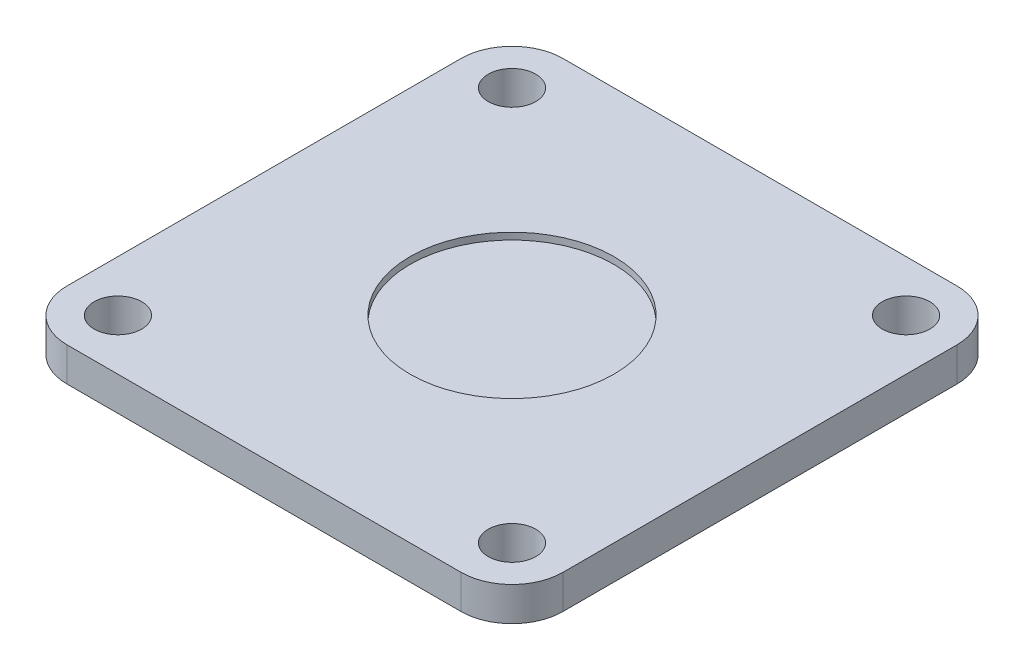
ISO-10303-21;
HEADER;
FILE_DESCRIPTION(('STEP AP214'),'2;1');
FILE_NAME('part.step','',(''),(''),'','','');
FILE_SCHEMA(('AUTOMOTIVE_DESIGN { 1 0 10303 214 1 1 1 1 }'));
ENDSEC;
DATA;
#1=APPLICATION_CONTEXT('core data for automotive mechanical design processes');
#2=APPLICATION_PROTOCOL_DEFINITION('international standard','automotive_design',2000,#1);
#3=PRODUCT_CONTEXT('',#1,'mechanical');
#4=PRODUCT('Part','Part','',(#3));
#5=PRODUCT_RELATED_PRODUCT_CATEGORY('part','',(#4));
#6=PRODUCT_DEFINITION_FORMATION('','',#4);
#7=PRODUCT_DEFINITION_CONTEXT('part definition',#1,'design');
#8=PRODUCT_DEFINITION('design','',#6,#7);
#9=PRODUCT_DEFINITION_SHAPE('','',#8);
#10=(LENGTH_UNIT() NAMED_UNIT(*) SI_UNIT(.MILLI.,.METRE.));
#11=(NAMED_UNIT(*) PLANE_ANGLE_UNIT() SI_UNIT($,.RADIAN.));
#12=(NAMED_UNIT(*) SI_UNIT($,.STERADIAN.) SOLID_ANGLE_UNIT());
#13=UNCERTAINTY_MEASURE_WITH_UNIT(LENGTH_MEASURE(1.E-05),#10,'distance_accuracy_value','');
#14=(GEOMETRIC_REPRESENTATION_CONTEXT(3) GLOBAL_UNCERTAINTY_ASSIGNED_CONTEXT((#13)) GLOBAL_UNIT_ASSIGNED_CONTEXT((#10,
#11,#12)) REPRESENTATION_CONTEXT('',''));
#15=CARTESIAN_POINT('',(0.,0.,0.));
#16=DIRECTION('',(0.,0.,1.));
#17=DIRECTION('',(1.,0.,0.));
#18=AXIS2_PLACEMENT_3D('',#15,#16,#17);
#19=CARTESIAN_POINT('',(29.,-5.,-36.5));
#20=DIRECTION('',(0.,0.,-1.));
#21=DIRECTION('',(0.,1.,0.));
#22=AXIS2_PLACEMENT_3D('',#19,#20,#21);
#23=PLANE('',#22);
#24=DIRECTION('',(-1.,0.,0.));
#25=VECTOR('',#24,1.);
#26=CARTESIAN_POINT('',(29.,0.,-36.5));
#27=LINE('',#26,#25);
#28=CARTESIAN_POINT('',(29.,0.,-36.5));
#29=VERTEX_POINT('',#28);
#30=CARTESIAN_POINT('',(-29.,0.,-36.5));
#31=VERTEX_POINT('',#30);
#32=EDGE_CURVE('E102',#29,#31,#27,.T.);
#33=ORIENTED_EDGE('',*,*,#32,.F.);
#34=DIRECTION('',(0.,1.,0.));
#35=VECTOR('',#34,1.);
#36=CARTESIAN_POINT('',(29.,-5.,-36.5));
#37=LINE('',#36,#35);
#38=CARTESIAN_POINT('',(29.,-5.,-36.5));
#39=VERTEX_POINT('',#38);
#40=EDGE_CURVE('E23',#39,#29,#37,.T.);
#41=ORIENTED_EDGE('',*,*,#40,.F.);
#42=DIRECTION('',(-1.,0.,0.));
#43=VECTOR('',#42,1.);
#44=CARTESIAN_POINT('',(29.,-5.,-36.5));
#45=LINE('',#44,#43);
#46=CARTESIAN_POINT('',(-29.,-5.,-36.5));
#47=VERTEX_POINT('',#46);
#48=EDGE_CURVE('E134',#39,#47,#45,.T.);
#49=ORIENTED_EDGE('',*,*,#48,.T.);
#50=DIRECTION('',(0.,1.,0.));
#51=VECTOR('',#50,1.);
#52=CARTESIAN_POINT('',(-29.,-5.,-36.5));
#53=LINE('',#52,#51);
#54=EDGE_CURVE('E94',#47,#31,#53,.T.);
#55=ORIENTED_EDGE('',*,*,#54,.T.);
#56=EDGE_LOOP('',(#33,#41,#49,#55));
#57=FACE_BOUND('',#56,.T.);
#58=ADVANCED_FACE('F15',(#57),#23,.T.);
#59=CARTESIAN_POINT('',(29.,-5.,-29.));
#60=DIRECTION('',(0.,1.,0.));
#61=DIRECTION('',(-1.,0.,0.));
#62=AXIS2_PLACEMENT_3D('',#59,#60,#61);
#63=CYLINDRICAL_SURFACE('',#62,7.5);
#64=CARTESIAN_POINT('',(29.,0.,-29.));
#65=DIRECTION('',(0.,-1.,0.));
#66=DIRECTION('',(1.,0.,0.));
#67=AXIS2_PLACEMENT_3D('',#64,#65,#66);
#68=CIRCLE('',#67,7.5);
#69=CARTESIAN_POINT('',(36.5,0.,-29.));
#70=VERTEX_POINT('',#69);
#71=EDGE_CURVE('E130',#29,#70,#68,.T.);
#72=ORIENTED_EDGE('',*,*,#71,.T.);
#73=DIRECTION('',(0.,1.,0.));
#74=VECTOR('',#73,1.);
#75=CARTESIAN_POINT('',(36.5,-5.,-29.));
#76=LINE('',#75,#74);
#77=CARTESIAN_POINT('',(36.5,-5.,-29.));
#78=VERTEX_POINT('',#77);
#79=EDGE_CURVE('E163',#78,#70,#76,.T.);
#80=ORIENTED_EDGE('',*,*,#79,.F.);
#81=CARTESIAN_POINT('',(29.,-5.,-29.));
#82=DIRECTION('',(0.,-1.,0.));
#83=DIRECTION('',(1.,0.,0.));
#84=AXIS2_PLACEMENT_3D('',#81,#82,#83);
#85=CIRCLE('',#84,7.5);
#86=EDGE_CURVE('E36',#39,#78,#85,.T.);
#87=ORIENTED_EDGE('',*,*,#86,.F.);
#88=ORIENTED_EDGE('',*,*,#40,.T.);
#89=EDGE_LOOP('',(#72,#80,#87,#88));
#90=FACE_BOUND('',#89,.T.);
#91=ADVANCED_FACE('F237',(#90),#63,.T.);
#92=CARTESIAN_POINT('',(36.5,-5.,29.));
#93=DIRECTION('',(1.,0.,0.));
#94=DIRECTION('',(0.,1.,0.));
#95=AXIS2_PLACEMENT_3D('',#92,#93,#94);
#96=PLANE('',#95);
#97=DIRECTION('',(0.,0.,-1.));
#98=VECTOR('',#97,1.);
#99=CARTESIAN_POINT('',(36.5,0.,29.));
#100=LINE('',#99,#98);
#101=CARTESIAN_POINT('',(36.5,0.,29.));
#102=VERTEX_POINT('',#101);
#103=EDGE_CURVE('E126',#102,#70,#100,.T.);
#104=ORIENTED_EDGE('',*,*,#103,.F.);
#105=DIRECTION('',(0.,1.,0.));
#106=VECTOR('',#105,1.);
#107=CARTESIAN_POINT('',(36.5,-5.,29.));
#108=LINE('',#107,#106);
#109=CARTESIAN_POINT('',(36.5,-5.,29.));
#110=VERTEX_POINT('',#109);
#111=EDGE_CURVE('E166',#110,#102,#108,.T.);
#112=ORIENTED_EDGE('',*,*,#111,.F.);
#113=DIRECTION('',(0.,0.,-1.));
#114=VECTOR('',#113,1.);
#115=CARTESIAN_POINT('',(36.5,-5.,29.));
#116=LINE('',#115,#114);
#117=EDGE_CURVE('E153',#110,#78,#116,.T.);
#118=ORIENTED_EDGE('',*,*,#117,.T.);
#119=ORIENTED_EDGE('',*,*,#79,.T.);
#120=EDGE_LOOP('',(#104,#112,#118,#119));
#121=FACE_BOUND('',#120,.T.);
#122=ADVANCED_FACE('F242',(#121),#96,.T.);
#123=CARTESIAN_POINT('',(29.,-5.,29.));
#124=DIRECTION('',(0.,1.,0.));
#125=DIRECTION('',(-1.,0.,0.));
#126=AXIS2_PLACEMENT_3D('',#123,#124,#125);
#127=CYLINDRICAL_SURFACE('',#126,7.5);
#128=CARTESIAN_POINT('',(29.,0.,29.));
#129=DIRECTION('',(0.,-1.,0.));
#130=DIRECTION('',(1.,0.,0.));
#131=AXIS2_PLACEMENT_3D('',#128,#129,#130);
#132=CIRCLE('',#131,7.5);
#133=CARTESIAN_POINT('',(29.,0.,36.5));
#134=VERTEX_POINT('',#133);
#135=EDGE_CURVE('E122',#102,#134,#132,.T.);
#136=ORIENTED_EDGE('',*,*,#135,.T.);
#137=DIRECTION('',(0.,1.,0.));
#138=VECTOR('',#137,1.);
#139=CARTESIAN_POINT('',(29.,-5.,36.5));
#140=LINE('',#139,#138);
#141=CARTESIAN_POINT('',(29.,-5.,36.5));
#142=VERTEX_POINT('',#141);
#143=EDGE_CURVE('E169',#142,#134,#140,.T.);
#144=ORIENTED_EDGE('',*,*,#143,.F.);
#145=CARTESIAN_POINT('',(29.,-5.,29.));
#146=DIRECTION('',(0.,-1.,0.));
#147=DIRECTION('',(1.,0.,0.));
#148=AXIS2_PLACEMENT_3D('',#145,#146,#147);
#149=CIRCLE('',#148,7.5);
#150=EDGE_CURVE('E150',#110,#142,#149,.T.);
#151=ORIENTED_EDGE('',*,*,#150,.F.);
#152=ORIENTED_EDGE('',*,*,#111,.T.);
#153=EDGE_LOOP('',(#136,#144,#151,#152));
#154=FACE_BOUND('',#153,.T.);
#155=ADVANCED_FACE('F248',(#154),#127,.T.);
#156=CARTESIAN_POINT('',(-29.,-5.,36.5));
#157=DIRECTION('',(0.,0.,1.));
#158=DIRECTION('',(0.,-1.,0.));
#159=AXIS2_PLACEMENT_3D('',#156,#157,#158);
#160=PLANE('',#159);
#161=DIRECTION('',(1.,0.,0.));
#162=VECTOR('',#161,1.);
#163=CARTESIAN_POINT('',(-29.,0.,36.5));
#164=LINE('',#163,#162);
#165=CARTESIAN_POINT('',(-29.,0.,36.5));
#166=VERTEX_POINT('',#165);
#167=EDGE_CURVE('E115',#166,#134,#164,.T.);
#168=ORIENTED_EDGE('',*,*,#167,.F.);
#169=DIRECTION('',(0.,1.,0.));
#170=VECTOR('',#169,1.);
#171=CARTESIAN_POINT('',(-29.,-5.,36.5));
#172=LINE('',#171,#170);
#173=CARTESIAN_POINT('',(-29.,-5.,36.5));
#174=VERTEX_POINT('',#173);
#175=EDGE_CURVE('E172',#174,#166,#172,.T.);
#176=ORIENTED_EDGE('',*,*,#175,.F.);
#177=DIRECTION('',(1.,0.,0.));
#178=VECTOR('',#177,1.);
#179=CARTESIAN_POINT('',(-29.,-5.,36.5));
#180=LINE('',#179,#178);
#181=EDGE_CURVE('E146',#174,#142,#180,.T.);
#182=ORIENTED_EDGE('',*,*,#181,.T.);
#183=ORIENTED_EDGE('',*,*,#143,.T.);
#184=EDGE_LOOP('',(#168,#176,#182,#183));
#185=FACE_BOUND('',#184,.T.);
#186=ADVANCED_FACE('F255',(#185),#160,.T.);
#187=CARTESIAN_POINT('',(-29.,-5.,29.));
#188=DIRECTION('',(0.,1.,0.));
#189=DIRECTION('',(-1.,0.,0.));
#190=AXIS2_PLACEMENT_3D('',#187,#188,#189);
#191=CYLINDRICAL_SURFACE('',#190,7.5);
#192=CARTESIAN_POINT('',(-29.,0.,29.));
#193=DIRECTION('',(0.,-1.,0.));
#194=DIRECTION('',(1.,0.,0.));
#195=AXIS2_PLACEMENT_3D('',#192,#193,#194);
#196=CIRCLE('',#195,7.5);
#197=CARTESIAN_POINT('',(-36.5,0.,29.));
#198=VERTEX_POINT('',#197);
#199=EDGE_CURVE('E109',#166,#198,#196,.T.);
#200=ORIENTED_EDGE('',*,*,#199,.T.);
#201=DIRECTION('',(0.,1.,0.));
#202=VECTOR('',#201,1.);
#203=CARTESIAN_POINT('',(-36.5,-5.,29.));
#204=LINE('',#203,#202);
#205=CARTESIAN_POINT('',(-36.5,-5.,29.));
#206=VERTEX_POINT('',#205);
#207=EDGE_CURVE('E93',#206,#198,#204,.T.);
#208=ORIENTED_EDGE('',*,*,#207,.F.);
#209=CARTESIAN_POINT('',(-29.,-5.,29.));
#210=DIRECTION('',(0.,-1.,0.));
#211=DIRECTION('',(1.,0.,0.));
#212=AXIS2_PLACEMENT_3D('',#209,#210,#211);
#213=CIRCLE('',#212,7.5);
#214=EDGE_CURVE('E143',#174,#206,#213,.T.);
#215=ORIENTED_EDGE('',*,*,#214,.F.);
#216=ORIENTED_EDGE('',*,*,#175,.T.);
#217=EDGE_LOOP('',(#200,#208,#215,#216));
#218=FACE_BOUND('',#217,.T.);
#219=ADVANCED_FACE('F259',(#218),#191,.T.);
#220=CARTESIAN_POINT('',(-36.5,-5.,-29.));
#221=DIRECTION('',(-1.,0.,0.));
#222=DIRECTION('',(0.,-1.,0.));
#223=AXIS2_PLACEMENT_3D('',#220,#221,#222);
#224=PLANE('',#223);
#225=DIRECTION('',(0.,0.,1.));
#226=VECTOR('',#225,1.);
#227=CARTESIAN_POINT('',(-36.5,0.,-29.));
#228=LINE('',#227,#226);
#229=CARTESIAN_POINT('',(-36.5,0.,-29.));
#230=VERTEX_POINT('',#229);
#231=EDGE_CURVE('E100',#230,#198,#228,.T.);
#232=ORIENTED_EDGE('',*,*,#231,.F.);
#233=DIRECTION('',(0.,1.,0.));
#234=VECTOR('',#233,1.);
#235=CARTESIAN_POINT('',(-36.5,-5.,-29.));
#236=LINE('',#235,#234);
#237=CARTESIAN_POINT('',(-36.5,-5.,-29.));
#238=VERTEX_POINT('',#237);
#239=EDGE_CURVE('E81',#238,#230,#236,.T.);
#240=ORIENTED_EDGE('',*,*,#239,.F.);
#241=DIRECTION('',(0.,0.,1.));
#242=VECTOR('',#241,1.);
#243=CARTESIAN_POINT('',(-36.5,-5.,-29.));
#244=LINE('',#243,#242);
#245=EDGE_CURVE('E140',#238,#206,#244,.T.);
#246=ORIENTED_EDGE('',*,*,#245,.T.);
#247=ORIENTED_EDGE('',*,*,#207,.T.);
#248=EDGE_LOOP('',(#232,#240,#246,#247));
#249=FACE_BOUND('',#248,.T.);
#250=ADVANCED_FACE('F105',(#249),#224,.T.);
#251=CARTESIAN_POINT('',(-29.,-5.,-29.));
#252=DIRECTION('',(0.,1.,0.));
#253=DIRECTION('',(-1.,0.,0.));
#254=AXIS2_PLACEMENT_3D('',#251,#252,#253);
#255=CYLINDRICAL_SURFACE('',#254,7.5);
#256=CARTESIAN_POINT('',(-29.,0.,-29.));
#257=DIRECTION('',(0.,-1.,0.));
#258=DIRECTION('',(1.,0.,0.));
#259=AXIS2_PLACEMENT_3D('',#256,#257,#258);
#260=CIRCLE('',#259,7.5);
#261=EDGE_CURVE('E85',#230,#31,#260,.T.);
#262=ORIENTED_EDGE('',*,*,#261,.T.);
#263=ORIENTED_EDGE('',*,*,#54,.F.);
#264=CARTESIAN_POINT('',(-29.,-5.,-29.));
#265=DIRECTION('',(0.,-1.,0.));
#266=DIRECTION('',(1.,0.,0.));
#267=AXIS2_PLACEMENT_3D('',#264,#265,#266);
#268=CIRCLE('',#267,7.5);
#269=EDGE_CURVE('E87',#238,#47,#268,.T.);
#270=ORIENTED_EDGE('',*,*,#269,.F.);
#271=ORIENTED_EDGE('',*,*,#239,.T.);
#272=EDGE_LOOP('',(#262,#263,#270,#271));
#273=FACE_BOUND('',#272,.T.);
#274=ADVANCED_FACE('F83',(#273),#255,.T.);
#275=CARTESIAN_POINT('',(-29.,-5.,-29.));
#276=DIRECTION('',(0.,-1.,0.));
#277=DIRECTION('',(1.,0.,0.));
#278=AXIS2_PLACEMENT_3D('',#275,#276,#277);
#279=PLANE('',#278);
#280=CARTESIAN_POINT('',(0.,-5.,0.));
#281=DIRECTION('',(0.,-1.,0.));
#282=DIRECTION('',(0.,0.,1.));
#283=AXIS2_PLACEMENT_3D('',#280,#281,#282);
#284=CIRCLE('',#283,20.);
#285=CARTESIAN_POINT('',(0.,-5.,20.));
#286=VERTEX_POINT('',#285);
#287=EDGE_CURVE('E10',#286,#286,#284,.T.);
#288=ORIENTED_EDGE('',*,*,#287,.F.);
#289=EDGE_LOOP('',(#288));
#290=FACE_BOUND('',#289,.T.);
#291=CARTESIAN_POINT('',(-29.,-5.,29.));
#292=DIRECTION('',(0.,-1.,0.));
#293=DIRECTION('',(0.,0.,1.));
#294=AXIS2_PLACEMENT_3D('',#291,#292,#293);
#295=CIRCLE('',#294,3.5);
#296=CARTESIAN_POINT('',(-29.,-5.,32.5));
#297=VERTEX_POINT('',#296);
#298=EDGE_CURVE('E192',#297,#297,#295,.T.);
#299=ORIENTED_EDGE('',*,*,#298,.F.);
#300=EDGE_LOOP('',(#299));
#301=FACE_BOUND('',#300,.T.);
#302=CARTESIAN_POINT('',(29.,-5.,29.));
#303=DIRECTION('',(0.,-1.,0.));
#304=DIRECTION('',(0.,0.,1.));
#305=AXIS2_PLACEMENT_3D('',#302,#303,#304);
#306=CIRCLE('',#305,3.5);
#307=CARTESIAN_POINT('',(29.,-5.,32.5));
#308=VERTEX_POINT('',#307);
#309=EDGE_CURVE('E188',#308,#308,#306,.T.);
#310=ORIENTED_EDGE('',*,*,#309,.F.);
#311=EDGE_LOOP('',(#310));
#312=FACE_BOUND('',#311,.T.);
#313=CARTESIAN_POINT('',(-29.,-5.,-29.));
#314=DIRECTION('',(0.,-1.,0.));
#315=DIRECTION('',(0.,0.,1.));
#316=AXIS2_PLACEMENT_3D('',#313,#314,#315);
#317=CIRCLE('',#316,3.5);
#318=CARTESIAN_POINT('',(-29.,-5.,-25.5));
#319=VERTEX_POINT('',#318);
#320=EDGE_CURVE('E183',#319,#319,#317,.T.);
#321=ORIENTED_EDGE('',*,*,#320,.F.);
#322=EDGE_LOOP('',(#321));
#323=FACE_BOUND('',#322,.T.);
#324=CARTESIAN_POINT('',(29.,-5.,-29.));
#325=DIRECTION('',(0.,-1.,0.));
#326=DIRECTION('',(0.,0.,1.));
#327=AXIS2_PLACEMENT_3D('',#324,#325,#326);
#328=CIRCLE('',#327,3.5);
#329=CARTESIAN_POINT('',(29.,-5.,-25.5));
#330=VERTEX_POINT('',#329);
#331=EDGE_CURVE('E137',#330,#330,#328,.T.);
#332=ORIENTED_EDGE('',*,*,#331,.F.);
#333=EDGE_LOOP('',(#332));
#334=FACE_BOUND('',#333,.T.);
#335=ORIENTED_EDGE('',*,*,#48,.F.);
#336=ORIENTED_EDGE('',*,*,#86,.T.);
#337=ORIENTED_EDGE('',*,*,#117,.F.);
#338=ORIENTED_EDGE('',*,*,#150,.T.);
#339=ORIENTED_EDGE('',*,*,#181,.F.);
#340=ORIENTED_EDGE('',*,*,#214,.T.);
#341=ORIENTED_EDGE('',*,*,#245,.F.);
#342=ORIENTED_EDGE('',*,*,#269,.T.);
#343=EDGE_LOOP('',(#335,#336,#337,#338,#339,#340,#341,#342));
#344=FACE_BOUND('',#343,.T.);
#345=ADVANCED_FACE('F232',(#290,#301,#312,#323,#334,#344),#279,.T.);
#346=CARTESIAN_POINT('',(-29.,0.,-29.));
#347=DIRECTION('',(0.,-1.,0.));
#348=DIRECTION('',(1.,0.,0.));
#349=AXIS2_PLACEMENT_3D('',#346,#347,#348);
#350=PLANE('',#349);
#351=CARTESIAN_POINT('',(0.,0.,0.));
#352=DIRECTION('',(0.,-1.,0.));
#353=DIRECTION('',(0.,0.,-1.));
#354=AXIS2_PLACEMENT_3D('',#351,#352,#353);
#355=CIRCLE('',#354,15.);
#356=CARTESIAN_POINT('',(0.,0.,-15.));
#357=VERTEX_POINT('',#356);
#358=EDGE_CURVE('E206',#357,#357,#355,.T.);
#359=ORIENTED_EDGE('',*,*,#358,.T.);
#360=EDGE_LOOP('',(#359));
#361=FACE_BOUND('',#360,.T.);
#362=CARTESIAN_POINT('',(-29.,0.,29.));
#363=DIRECTION('',(0.,-1.,0.));
#364=DIRECTION('',(0.,0.,1.));
#365=AXIS2_PLACEMENT_3D('',#362,#363,#364);
#366=CIRCLE('',#365,3.5);
#367=CARTESIAN_POINT('',(-29.,0.,32.5));
#368=VERTEX_POINT('',#367);
#369=EDGE_CURVE('E193',#368,#368,#366,.T.);
#370=ORIENTED_EDGE('',*,*,#369,.T.);
#371=EDGE_LOOP('',(#370));
#372=FACE_BOUND('',#371,.T.);
#373=CARTESIAN_POINT('',(29.,0.,29.));
#374=DIRECTION('',(0.,-1.,0.));
#375=DIRECTION('',(0.,0.,1.));
#376=AXIS2_PLACEMENT_3D('',#373,#374,#375);
#377=CIRCLE('',#376,3.5);
#378=CARTESIAN_POINT('',(29.,0.,32.5));
#379=VERTEX_POINT('',#378);
#380=EDGE_CURVE('E189',#379,#379,#377,.T.);
#381=ORIENTED_EDGE('',*,*,#380,.T.);
#382=EDGE_LOOP('',(#381));
#383=FACE_BOUND('',#382,.T.);
#384=CARTESIAN_POINT('',(-29.,0.,-29.));
#385=DIRECTION('',(0.,-1.,0.));
#386=DIRECTION('',(0.,0.,1.));
#387=AXIS2_PLACEMENT_3D('',#384,#385,#386);
#388=CIRCLE('',#387,3.5);
#389=CARTESIAN_POINT('',(-29.,0.,-25.5));
#390=VERTEX_POINT('',#389);
#391=EDGE_CURVE('E184',#390,#390,#388,.T.);
#392=ORIENTED_EDGE('',*,*,#391,.T.);
#393=EDGE_LOOP('',(#392));
#394=FACE_BOUND('',#393,.T.);
#395=CARTESIAN_POINT('',(29.,0.,-29.));
#396=DIRECTION('',(0.,-1.,0.));
#397=DIRECTION('',(0.,0.,1.));
#398=AXIS2_PLACEMENT_3D('',#395,#396,#397);
#399=CIRCLE('',#398,3.5);
#400=CARTESIAN_POINT('',(29.,0.,-25.5));
#401=VERTEX_POINT('',#400);
#402=EDGE_CURVE('E179',#401,#401,#399,.T.);
#403=ORIENTED_EDGE('',*,*,#402,.T.);
#404=EDGE_LOOP('',(#403));
#405=FACE_BOUND('',#404,.T.);
#406=ORIENTED_EDGE('',*,*,#32,.T.);
#407=ORIENTED_EDGE('',*,*,#261,.F.);
#408=ORIENTED_EDGE('',*,*,#231,.T.);
#409=ORIENTED_EDGE('',*,*,#199,.F.);
#410=ORIENTED_EDGE('',*,*,#167,.T.);
#411=ORIENTED_EDGE('',*,*,#135,.F.);
#412=ORIENTED_EDGE('',*,*,#103,.T.);
#413=ORIENTED_EDGE('',*,*,#71,.F.);
#414=EDGE_LOOP('',(#406,#407,#408,#409,#410,#411,#412,#413));
#415=FACE_BOUND('',#414,.T.);
#416=ADVANCED_FACE('F98',(#361,#372,#383,#394,#405,#415),#350,.F.);
#417=CARTESIAN_POINT('',(29.,1.,-29.));
#418=DIRECTION('',(0.,-1.,0.));
#419=DIRECTION('',(0.,0.,-1.));
#420=AXIS2_PLACEMENT_3D('',#417,#418,#419);
#421=CYLINDRICAL_SURFACE('',#420,3.5);
#422=ORIENTED_EDGE('',*,*,#331,.T.);
#423=EDGE_LOOP('',(#422));
#424=FACE_BOUND('',#423,.T.);
#425=ORIENTED_EDGE('',*,*,#402,.F.);
#426=EDGE_LOOP('',(#425));
#427=FACE_BOUND('',#426,.T.);
#428=ADVANCED_FACE('F229',(#424,#427),#421,.F.);
#429=CARTESIAN_POINT('',(-29.,1.,-29.));
#430=DIRECTION('',(0.,-1.,0.));
#431=DIRECTION('',(0.,0.,-1.));
#432=AXIS2_PLACEMENT_3D('',#429,#430,#431);
#433=CYLINDRICAL_SURFACE('',#432,3.5);
#434=ORIENTED_EDGE('',*,*,#320,.T.);
#435=EDGE_LOOP('',(#434));
#436=FACE_BOUND('',#435,.T.);
#437=ORIENTED_EDGE('',*,*,#391,.F.);
#438=EDGE_LOOP('',(#437));
#439=FACE_BOUND('',#438,.T.);
#440=ADVANCED_FACE('F288',(#436,#439),#433,.F.);
#441=CARTESIAN_POINT('',(29.,1.,29.));
#442=DIRECTION('',(0.,-1.,0.));
#443=DIRECTION('',(0.,0.,-1.));
#444=AXIS2_PLACEMENT_3D('',#441,#442,#443);
#445=CYLINDRICAL_SURFACE('',#444,3.5);
#446=ORIENTED_EDGE('',*,*,#309,.T.);
#447=EDGE_LOOP('',(#446));
#448=FACE_BOUND('',#447,.T.);
#449=ORIENTED_EDGE('',*,*,#380,.F.);
#450=EDGE_LOOP('',(#449));
#451=FACE_BOUND('',#450,.T.);
#452=ADVANCED_FACE('F295',(#448,#451),#445,.F.);
#453=CARTESIAN_POINT('',(-29.,1.,29.));
#454=DIRECTION('',(0.,-1.,0.));
#455=DIRECTION('',(0.,0.,-1.));
#456=AXIS2_PLACEMENT_3D('',#453,#454,#455);
#457=CYLINDRICAL_SURFACE('',#456,3.5);
#458=ORIENTED_EDGE('',*,*,#298,.T.);
#459=EDGE_LOOP('',(#458));
#460=FACE_BOUND('',#459,.T.);
#461=ORIENTED_EDGE('',*,*,#369,.F.);
#462=EDGE_LOOP('',(#461));
#463=FACE_BOUND('',#462,.T.);
#464=ADVANCED_FACE('F303',(#460,#463),#457,.F.);
#465=CARTESIAN_POINT('',(0.,-1.,0.));
#466=DIRECTION('',(0.,-1.,0.));
#467=DIRECTION('',(1.,0.,0.));
#468=AXIS2_PLACEMENT_3D('',#465,#466,#467);
#469=PLANE('',#468);
#470=CARTESIAN_POINT('',(0.,-1.,0.));
#471=DIRECTION('',(0.,1.,0.));
#472=DIRECTION('',(0.,0.,-1.));
#473=AXIS2_PLACEMENT_3D('',#470,#471,#472);
#474=CIRCLE('',#473,15.);
#475=CARTESIAN_POINT('',(0.,-1.,-15.));
#476=VERTEX_POINT('',#475);
#477=EDGE_CURVE('E196',#476,#476,#474,.T.);
#478=ORIENTED_EDGE('',*,*,#477,.T.);
#479=EDGE_LOOP('',(#478));
#480=FACE_BOUND('',#479,.T.);
#481=ADVANCED_FACE('F311',(#480),#469,.F.);
#482=CARTESIAN_POINT('',(0.,0.,0.));
#483=DIRECTION('',(0.,-1.,0.));
#484=DIRECTION('',(0.,0.,-1.));
#485=AXIS2_PLACEMENT_3D('',#482,#483,#484);
#486=CYLINDRICAL_SURFACE('',#485,15.);
#487=ORIENTED_EDGE('',*,*,#477,.F.);
#488=EDGE_LOOP('',(#487));
#489=FACE_BOUND('',#488,.T.);
#490=ORIENTED_EDGE('',*,*,#358,.F.);
#491=EDGE_LOOP('',(#490));
#492=FACE_BOUND('',#491,.T.);
#493=ADVANCED_FACE('F319',(#489,#492),#486,.F.);
#494=CARTESIAN_POINT('',(0.,-20.,0.));
#495=DIRECTION('',(0.,-1.,0.));
#496=DIRECTION('',(1.,0.,0.));
#497=AXIS2_PLACEMENT_3D('',#494,#495,#496);
#498=PLANE('',#497);
#499=CARTESIAN_POINT('',(0.,-20.,0.));
#500=DIRECTION('',(0.,1.,0.));
#501=DIRECTION('',(0.,0.,-1.));
#502=AXIS2_PLACEMENT_3D('',#499,#500,#501);
#503=CIRCLE('',#502,20.);
#504=CARTESIAN_POINT('',(0.,-20.,-20.));
#505=VERTEX_POINT('',#504);
#506=EDGE_CURVE('E214',#505,#505,#503,.T.);
#507=ORIENTED_EDGE('',*,*,#506,.F.);
#508=EDGE_LOOP('',(#507));
#509=FACE_BOUND('',#508,.T.);
#510=ADVANCED_FACE('F326',(#509),#498,.T.);
#511=CARTESIAN_POINT('',(0.,-5.,0.));
#512=DIRECTION('',(0.,-1.,0.));
#513=DIRECTION('',(0.,0.,-1.));
#514=AXIS2_PLACEMENT_3D('',#511,#512,#513);
#515=CYLINDRICAL_SURFACE('',#514,20.);
#516=ORIENTED_EDGE('',*,*,#506,.T.);
#517=EDGE_LOOP('',(#516));
#518=FACE_BOUND('',#517,.T.);
#519=ORIENTED_EDGE('',*,*,#287,.T.);
#520=EDGE_LOOP('',(#519));
#521=FACE_BOUND('',#520,.T.);
#522=ADVANCED_FACE('F334',(#518,#521),#515,.T.);
#523=CLOSED_SHELL('',(#58,#91,#122,#155,#186,#219,#250,#274,#345,#416,#428,#440,#452,#464,#481,
#493,#510,#522));
#524=MANIFOLD_SOLID_BREP('B1',#523);
#525=ADVANCED_BREP_SHAPE_REPRESENTATION('',(#18,#524),#14);
#526=SHAPE_DEFINITION_REPRESENTATION(#9,#525);
ENDSEC;
END-ISO-10303-21;
